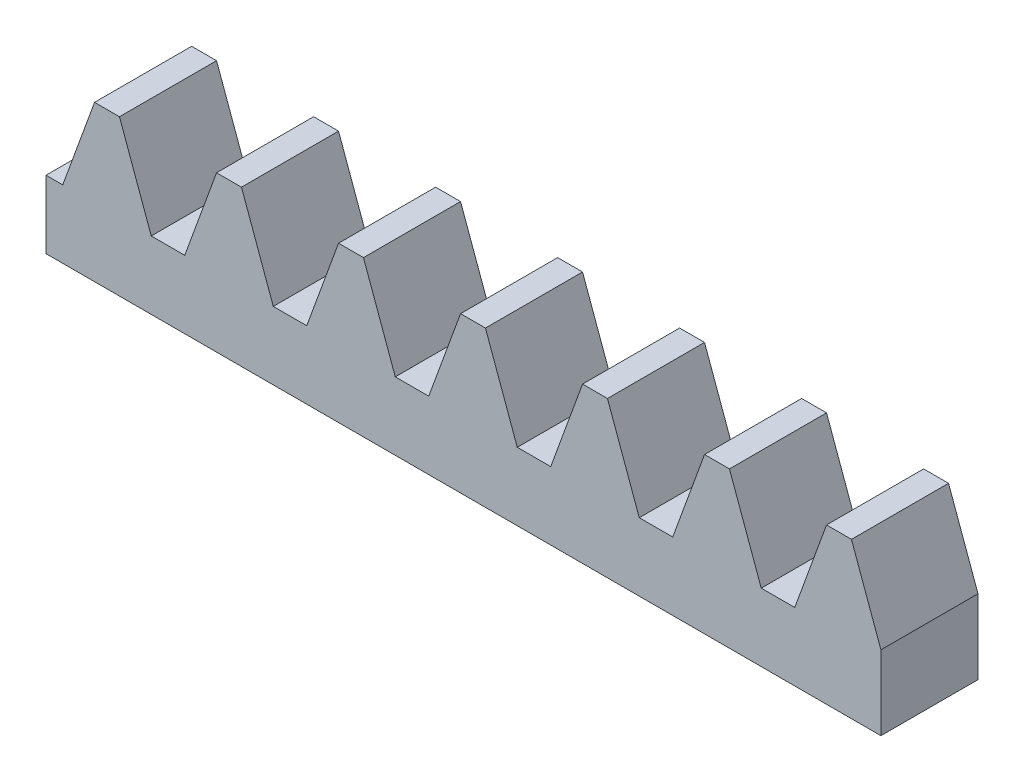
from build123d import *

# Parameters (mm, degrees)
BLANKSKE_W        = 43
BLANKSKE_H        = 8
BLANK_DEPTH       = 5
TOOTHCUTSIM_DEPTH = 45.022721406
TEETHCUTS_COUNT   = 8
TEETHCUTS_PITCH   = 6.2831853


with BuildPart() as part:
    # BlankSke → Blank (new body)
    with BuildSketch(Plane.XY):
        with Locations((21.5, 4)):
            Rectangle(BLANKSKE_W, BLANKSKE_H)
    extrude(amount=-BLANK_DEPTH)

    # TooCutSkeSim → ToothCutSim (cut, through all)
    with BuildSketch(Plane.XY):
        Polygon((0.861870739, 3.5), (-0.861870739, 3.5), (-2.508981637, 8.0254), (2.508981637, 8.0254), align=None)
    toothcutsim = extrude(amount=-TOOTHCUTSIM_DEPTH, mode=Mode.SUBTRACT)

    # TeethCuts: ToothCutSim ×8
    with Locations(*[(i * TEETHCUTS_PITCH, 0, 0) for i in range(1, TEETHCUTS_COUNT)]):
        add(toothcutsim, mode=Mode.SUBTRACT)


solid = part.part
